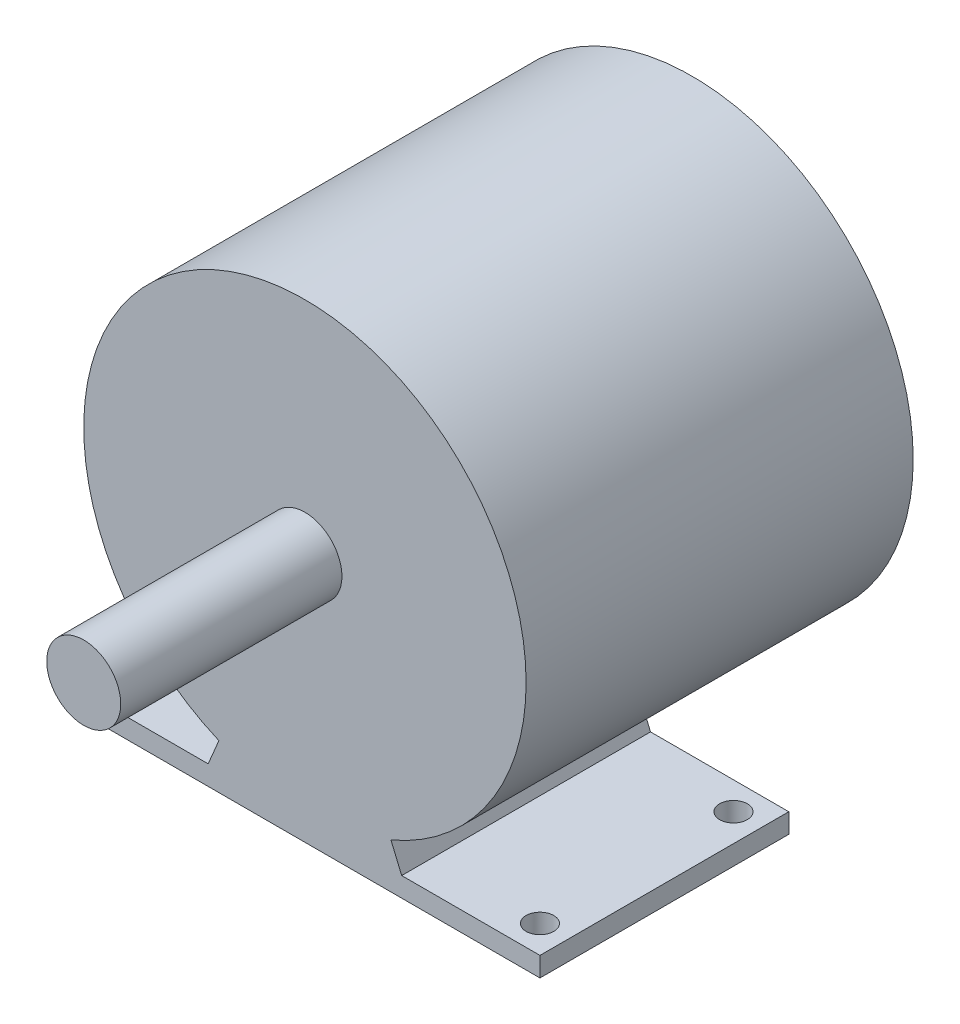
from build123d import *

# Parameters (mm, degrees)
BOSS_EXTRUDE1_DEPTH             = 44.45
BOSS_EXTRUDE1_DEPTH_BACK        = 44.45
SKETCH1_R                       = 50.8
SKETCH2_R                       = 8.4999957
BOSS_EXTRUDE2_DEPTH             = 50.8
BOSS_EXTRUDE3_DEPTH             = 57.15
F_1_4_0_25_DIAMETER_HOLE2_D     = 6.35
F_1_4_0_25_DIAMETER_HOLE2_DEPTH = 4.498581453


with BuildPart() as part:
    # Sketch1 → Boss-Extrude1 (new, two sides: drawn at the far end of the back side and taken through both)
    with BuildSketch(Plane.XY.offset(-BOSS_EXTRUDE1_DEPTH_BACK)):
        Circle(SKETCH1_R)
    extrude(amount=BOSS_EXTRUDE1_DEPTH + BOSS_EXTRUDE1_DEPTH_BACK)

    # Sketch2 → Boss-Extrude2 (add)
    with BuildSketch(Plane.XY.offset(44.45)):
        Circle(SKETCH2_R)
    extrude(amount=BOSS_EXTRUDE2_DEPTH)

    # Sketch6 → Boss-Extrude3 (add)
    with BuildSketch(Plane.XY.offset(44.45)):
        with BuildLine():
            Line((-19.755555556, -46.801260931), (-22.225, -52.651418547))
            Line((-22.225, -52.651418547), (-53.975, -52.651418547))
            Line((-53.975, -52.651418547), (-53.975, -57.15))
            Line((-53.975, -57.15), (53.975, -57.15))
            Line((53.975, -57.15), (53.975, -52.651418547))
            Line((53.975, -52.651418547), (22.225, -52.651418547))
            Line((22.225, -52.651418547), (19.755555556, -46.801260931))
            ThreePointArc((19.755555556, -46.801260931), (0, -50.8), (-19.755555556, -46.801260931))
        make_face()
    extrude(amount=-BOSS_EXTRUDE3_DEPTH)

    # 1_4 _0.25_ Diameter Hole2
    with Locations(Plane(origin=(0, -57.15, 0), x_dir=(-1, 0, 0), z_dir=(0, -1, 0))):
        with Locations((47.625, -38.1), (47.625, 6.35), (-47.625, 6.35), (-47.625, -38.1)):
            Hole(F_1_4_0_25_DIAMETER_HOLE2_D / 2, depth=F_1_4_0_25_DIAMETER_HOLE2_DEPTH)


solid = part.part
